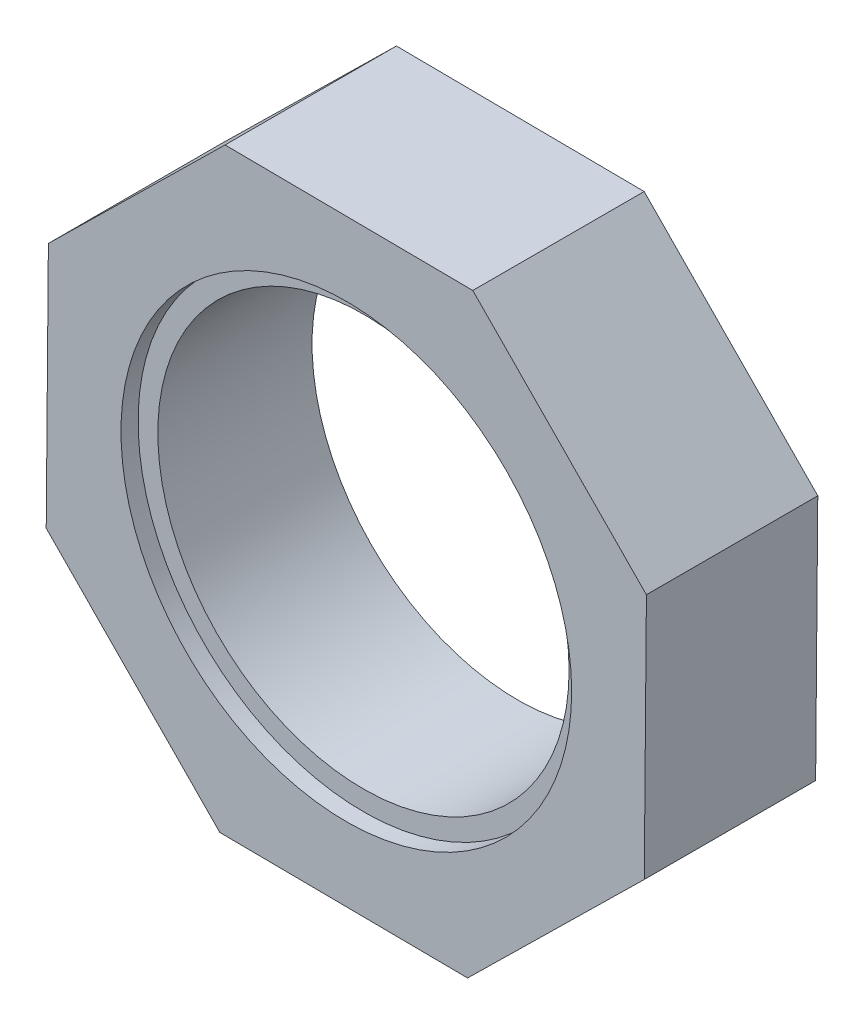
from build123d import *

# Parameters (mm, degrees)
BOSS_EXTRU_2_DEPTH      = 10
ESQUISSE5_R             = 12
ENL_V_MAT_EXTRU_2_DEPTH = 27.70897024
ESQUISSE6_R             = 13.15
ENL_V_MAT_EXTRU_3_DEPTH = 1


with BuildPart() as part:
    # Esquisse4 → Boss.-Extru.2 (new body)
    with BuildSketch(Plane.XY):
        Polygon((17.512411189, 7.075473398), (7.380029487, 17.386259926), (-7.075473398, 17.512411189), (-17.386259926, 7.380029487), (-17.512411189, -7.075473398), (-7.380029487, -17.386259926), (7.075473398, -17.512411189), (17.386259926, -7.380029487), align=None)
    extrude(amount=BOSS_EXTRU_2_DEPTH)

    # Esquisse5 → Enl_v. mat.-Extru.2 (cut, through all)
    with BuildSketch(Plane.XY.offset(10)):
        Circle(ESQUISSE5_R)
    extrude(amount=-ENL_V_MAT_EXTRU_2_DEPTH, mode=Mode.SUBTRACT)

    # Esquisse6 → Enl_v. mat.-Extru.3 (cut)
    with BuildSketch(Plane.XY.offset(10)):
        Circle(ESQUISSE6_R)
    extrude(amount=-ENL_V_MAT_EXTRU_3_DEPTH, mode=Mode.SUBTRACT)


solid = part.part
